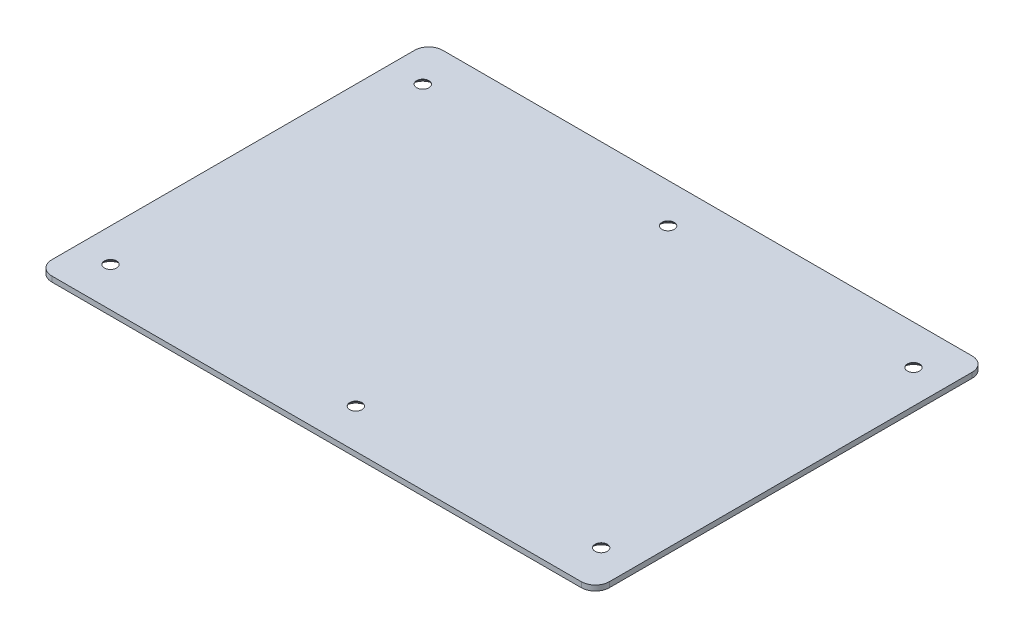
ISO-10303-21;
HEADER;
FILE_DESCRIPTION(('STEP AP214'),'2;1');
FILE_NAME('part.step','',(''),(''),'','','');
FILE_SCHEMA(('AUTOMOTIVE_DESIGN { 1 0 10303 214 1 1 1 1 }'));
ENDSEC;
DATA;
#1=APPLICATION_CONTEXT('core data for automotive mechanical design processes');
#2=APPLICATION_PROTOCOL_DEFINITION('international standard','automotive_design',2000,#1);
#3=PRODUCT_CONTEXT('',#1,'mechanical');
#4=PRODUCT('Part','Part','',(#3));
#5=PRODUCT_RELATED_PRODUCT_CATEGORY('part','',(#4));
#6=PRODUCT_DEFINITION_FORMATION('','',#4);
#7=PRODUCT_DEFINITION_CONTEXT('part definition',#1,'design');
#8=PRODUCT_DEFINITION('design','',#6,#7);
#9=PRODUCT_DEFINITION_SHAPE('','',#8);
#10=(LENGTH_UNIT() NAMED_UNIT(*) SI_UNIT(.MILLI.,.METRE.));
#11=(NAMED_UNIT(*) PLANE_ANGLE_UNIT() SI_UNIT($,.RADIAN.));
#12=(NAMED_UNIT(*) SI_UNIT($,.STERADIAN.) SOLID_ANGLE_UNIT());
#13=UNCERTAINTY_MEASURE_WITH_UNIT(LENGTH_MEASURE(1.E-05),#10,'distance_accuracy_value','');
#14=(GEOMETRIC_REPRESENTATION_CONTEXT(3) GLOBAL_UNCERTAINTY_ASSIGNED_CONTEXT((#13)) GLOBAL_UNIT_ASSIGNED_CONTEXT((#10,
#11,#12)) REPRESENTATION_CONTEXT('',''));
#15=CARTESIAN_POINT('',(0.,0.,0.));
#16=DIRECTION('',(0.,0.,1.));
#17=DIRECTION('',(1.,0.,0.));
#18=AXIS2_PLACEMENT_3D('',#15,#16,#17);
#19=CARTESIAN_POINT('',(0.,-1.5,0.));
#20=DIRECTION('',(0.,1.,0.));
#21=DIRECTION('',(0.,0.,1.));
#22=AXIS2_PLACEMENT_3D('',#19,#20,#21);
#23=PLANE('',#22);
#24=DIRECTION('',(1.,0.,0.));
#25=VECTOR('',#24,1.);
#26=CARTESIAN_POINT('',(-79.375,-1.5,0.));
#27=LINE('',#26,#25);
#28=CARTESIAN_POINT('',(-75.375,-1.5,0.));
#29=VERTEX_POINT('',#28);
#30=CARTESIAN_POINT('',(75.3749999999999,-1.5,0.));
#31=VERTEX_POINT('',#30);
#32=EDGE_CURVE('E261',#29,#31,#27,.T.);
#33=ORIENTED_EDGE('',*,*,#32,.F.);
#34=CARTESIAN_POINT('',(-75.375,-1.5,-4.));
#35=DIRECTION('',(0.,1.,0.));
#36=DIRECTION('',(0.,0.,1.));
#37=AXIS2_PLACEMENT_3D('',#34,#35,#36);
#38=CIRCLE('',#37,4.);
#39=CARTESIAN_POINT('',(-79.375,-1.5,-4.));
#40=VERTEX_POINT('',#39);
#41=EDGE_CURVE('E184',#29,#40,#38,.F.);
#42=ORIENTED_EDGE('',*,*,#41,.T.);
#43=DIRECTION('',(0.,0.,1.));
#44=VECTOR('',#43,1.);
#45=CARTESIAN_POINT('',(-79.375,-1.5,-111.3));
#46=LINE('',#45,#44);
#47=CARTESIAN_POINT('',(-79.375,-1.5,-107.3));
#48=VERTEX_POINT('',#47);
#49=EDGE_CURVE('E264',#48,#40,#46,.T.);
#50=ORIENTED_EDGE('',*,*,#49,.F.);
#51=CARTESIAN_POINT('',(-75.375,-1.5,-107.3));
#52=DIRECTION('',(0.,1.,0.));
#53=DIRECTION('',(0.,0.,1.));
#54=AXIS2_PLACEMENT_3D('',#51,#52,#53);
#55=CIRCLE('',#54,4.);
#56=CARTESIAN_POINT('',(-75.375,-1.5,-111.3));
#57=VERTEX_POINT('',#56);
#58=EDGE_CURVE('E148',#48,#57,#55,.F.);
#59=ORIENTED_EDGE('',*,*,#58,.T.);
#60=DIRECTION('',(-1.,0.,0.));
#61=VECTOR('',#60,1.);
#62=CARTESIAN_POINT('',(-79.375,-1.5,-111.3));
#63=LINE('',#62,#61);
#64=CARTESIAN_POINT('',(75.3749999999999,-1.5,-111.3));
#65=VERTEX_POINT('',#64);
#66=EDGE_CURVE('E150',#65,#57,#63,.T.);
#67=ORIENTED_EDGE('',*,*,#66,.F.);
#68=CARTESIAN_POINT('',(75.375,-1.5,-107.3));
#69=DIRECTION('',(0.,1.,0.));
#70=DIRECTION('',(0.,0.,1.));
#71=AXIS2_PLACEMENT_3D('',#68,#69,#70);
#72=CIRCLE('',#71,4.);
#73=CARTESIAN_POINT('',(79.375,-1.5,-107.3));
#74=VERTEX_POINT('',#73);
#75=EDGE_CURVE('E69',#65,#74,#72,.F.);
#76=ORIENTED_EDGE('',*,*,#75,.T.);
#77=DIRECTION('',(0.,0.,-1.));
#78=VECTOR('',#77,1.);
#79=CARTESIAN_POINT('',(79.375,-1.5,-111.3));
#80=LINE('',#79,#78);
#81=CARTESIAN_POINT('',(79.375,-1.5,-4.));
#82=VERTEX_POINT('',#81);
#83=EDGE_CURVE('E159',#82,#74,#80,.T.);
#84=ORIENTED_EDGE('',*,*,#83,.F.);
#85=CARTESIAN_POINT('',(75.375,-1.5,-4.));
#86=DIRECTION('',(0.,1.,0.));
#87=DIRECTION('',(0.,0.,1.));
#88=AXIS2_PLACEMENT_3D('',#85,#86,#87);
#89=CIRCLE('',#88,4.);
#90=EDGE_CURVE('E177',#82,#31,#89,.F.);
#91=ORIENTED_EDGE('',*,*,#90,.T.);
#92=EDGE_LOOP('',(#33,#42,#50,#59,#67,#76,#84,#91));
#93=FACE_BOUND('',#92,.T.);
#94=CARTESIAN_POINT('',(0.,-1.5,-100.1));
#95=DIRECTION('',(0.,-1.,0.));
#96=DIRECTION('',(0.,0.,-1.));
#97=AXIS2_PLACEMENT_3D('',#94,#95,#96);
#98=CIRCLE('',#97,3.15);
#99=CARTESIAN_POINT('',(0.,-1.5,-103.25));
#100=VERTEX_POINT('',#99);
#101=EDGE_CURVE('E201',#100,#100,#98,.T.);
#102=ORIENTED_EDGE('',*,*,#101,.F.);
#103=EDGE_LOOP('',(#102));
#104=FACE_BOUND('',#103,.T.);
#105=CARTESIAN_POINT('',(0.,-1.5,-11.2));
#106=DIRECTION('',(0.,-1.,0.));
#107=DIRECTION('',(0.,0.,-1.));
#108=AXIS2_PLACEMENT_3D('',#105,#106,#107);
#109=CIRCLE('',#108,3.15);
#110=CARTESIAN_POINT('',(0.,-1.5,-14.35));
#111=VERTEX_POINT('',#110);
#112=EDGE_CURVE('E245',#111,#111,#109,.T.);
#113=ORIENTED_EDGE('',*,*,#112,.F.);
#114=EDGE_LOOP('',(#113));
#115=FACE_BOUND('',#114,.T.);
#116=CARTESIAN_POINT('',(-69.85,-1.5,-100.1));
#117=DIRECTION('',(0.,-1.,0.));
#118=DIRECTION('',(0.,0.,-1.));
#119=AXIS2_PLACEMENT_3D('',#116,#117,#118);
#120=CIRCLE('',#119,3.15);
#121=CARTESIAN_POINT('',(-69.85,-1.5,-103.25));
#122=VERTEX_POINT('',#121);
#123=EDGE_CURVE('E237',#122,#122,#120,.T.);
#124=ORIENTED_EDGE('',*,*,#123,.F.);
#125=EDGE_LOOP('',(#124));
#126=FACE_BOUND('',#125,.T.);
#127=CARTESIAN_POINT('',(-69.85,-1.5,-11.2));
#128=DIRECTION('',(0.,-1.,0.));
#129=DIRECTION('',(0.,0.,-1.));
#130=AXIS2_PLACEMENT_3D('',#127,#128,#129);
#131=CIRCLE('',#130,3.15);
#132=CARTESIAN_POINT('',(-69.85,-1.5,-14.35));
#133=VERTEX_POINT('',#132);
#134=EDGE_CURVE('E297',#133,#133,#131,.T.);
#135=ORIENTED_EDGE('',*,*,#134,.F.);
#136=EDGE_LOOP('',(#135));
#137=FACE_BOUND('',#136,.T.);
#138=CARTESIAN_POINT('',(69.85,-1.5,-11.2));
#139=DIRECTION('',(0.,-1.,0.));
#140=DIRECTION('',(0.,0.,-1.));
#141=AXIS2_PLACEMENT_3D('',#138,#139,#140);
#142=CIRCLE('',#141,3.15);
#143=CARTESIAN_POINT('',(69.85,-1.5,-14.35));
#144=VERTEX_POINT('',#143);
#145=EDGE_CURVE('E273',#144,#144,#142,.T.);
#146=ORIENTED_EDGE('',*,*,#145,.F.);
#147=EDGE_LOOP('',(#146));
#148=FACE_BOUND('',#147,.T.);
#149=CARTESIAN_POINT('',(69.85,-1.5,-100.1));
#150=DIRECTION('',(0.,-1.,0.));
#151=DIRECTION('',(0.,0.,-1.));
#152=AXIS2_PLACEMENT_3D('',#149,#150,#151);
#153=CIRCLE('',#152,3.15);
#154=CARTESIAN_POINT('',(69.85,-1.5,-103.25));
#155=VERTEX_POINT('',#154);
#156=EDGE_CURVE('E211',#155,#155,#153,.T.);
#157=ORIENTED_EDGE('',*,*,#156,.F.);
#158=EDGE_LOOP('',(#157));
#159=FACE_BOUND('',#158,.T.);
#160=ADVANCED_FACE('F53',(#93,#104,#115,#126,#137,#148,#159),#23,.F.);
#161=CARTESIAN_POINT('',(-79.375,-1.5,-111.3));
#162=DIRECTION('',(-1.,0.,0.));
#163=DIRECTION('',(0.,0.,1.));
#164=AXIS2_PLACEMENT_3D('',#161,#162,#163);
#165=PLANE('',#164);
#166=ORIENTED_EDGE('',*,*,#49,.T.);
#167=DIRECTION('',(0.,1.,0.));
#168=VECTOR('',#167,1.);
#169=CARTESIAN_POINT('',(-79.375,-1.5,-4.));
#170=LINE('',#169,#168);
#171=CARTESIAN_POINT('',(-79.375,0.,-4.));
#172=VERTEX_POINT('',#171);
#173=EDGE_CURVE('E141',#40,#172,#170,.T.);
#174=ORIENTED_EDGE('',*,*,#173,.T.);
#175=DIRECTION('',(0.,0.,1.));
#176=VECTOR('',#175,1.);
#177=CARTESIAN_POINT('',(-79.375,0.,-111.3));
#178=LINE('',#177,#176);
#179=CARTESIAN_POINT('',(-79.375,0.,-107.3));
#180=VERTEX_POINT('',#179);
#181=EDGE_CURVE('E123',#180,#172,#178,.T.);
#182=ORIENTED_EDGE('',*,*,#181,.F.);
#183=DIRECTION('',(0.,1.,0.));
#184=VECTOR('',#183,1.);
#185=CARTESIAN_POINT('',(-79.375,-1.5,-107.3));
#186=LINE('',#185,#184);
#187=EDGE_CURVE('E138',#180,#48,#186,.F.);
#188=ORIENTED_EDGE('',*,*,#187,.T.);
#189=EDGE_LOOP('',(#166,#174,#182,#188));
#190=FACE_BOUND('',#189,.T.);
#191=ADVANCED_FACE('F137',(#190),#165,.T.);
#192=CARTESIAN_POINT('',(-79.375,-1.5,-111.3));
#193=DIRECTION('',(0.,0.,-1.));
#194=DIRECTION('',(-1.,0.,0.));
#195=AXIS2_PLACEMENT_3D('',#192,#193,#194);
#196=PLANE('',#195);
#197=ORIENTED_EDGE('',*,*,#66,.T.);
#198=DIRECTION('',(0.,1.,0.));
#199=VECTOR('',#198,1.);
#200=CARTESIAN_POINT('',(-75.375,-1.5,-111.3));
#201=LINE('',#200,#199);
#202=CARTESIAN_POINT('',(-75.375,0.,-111.3));
#203=VERTEX_POINT('',#202);
#204=EDGE_CURVE('E190',#57,#203,#201,.T.);
#205=ORIENTED_EDGE('',*,*,#204,.T.);
#206=DIRECTION('',(-1.,0.,0.));
#207=VECTOR('',#206,1.);
#208=CARTESIAN_POINT('',(-79.375,0.,-111.3));
#209=LINE('',#208,#207);
#210=CARTESIAN_POINT('',(75.3749999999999,0.,-111.3));
#211=VERTEX_POINT('',#210);
#212=EDGE_CURVE('E125',#211,#203,#209,.T.);
#213=ORIENTED_EDGE('',*,*,#212,.F.);
#214=DIRECTION('',(0.,1.,0.));
#215=VECTOR('',#214,1.);
#216=CARTESIAN_POINT('',(75.375,-1.5,-111.3));
#217=LINE('',#216,#215);
#218=EDGE_CURVE('E187',#211,#65,#217,.F.);
#219=ORIENTED_EDGE('',*,*,#218,.T.);
#220=EDGE_LOOP('',(#197,#205,#213,#219));
#221=FACE_BOUND('',#220,.T.);
#222=ADVANCED_FACE('F376',(#221),#196,.T.);
#223=CARTESIAN_POINT('',(79.375,-1.5,-111.3));
#224=DIRECTION('',(1.,0.,0.));
#225=DIRECTION('',(0.,0.,-1.));
#226=AXIS2_PLACEMENT_3D('',#223,#224,#225);
#227=PLANE('',#226);
#228=ORIENTED_EDGE('',*,*,#83,.T.);
#229=DIRECTION('',(0.,1.,0.));
#230=VECTOR('',#229,1.);
#231=CARTESIAN_POINT('',(79.375,-1.5,-107.3));
#232=LINE('',#231,#230);
#233=CARTESIAN_POINT('',(79.375,0.,-107.3));
#234=VERTEX_POINT('',#233);
#235=EDGE_CURVE('E11',#74,#234,#232,.T.);
#236=ORIENTED_EDGE('',*,*,#235,.T.);
#237=DIRECTION('',(0.,0.,-1.));
#238=VECTOR('',#237,1.);
#239=CARTESIAN_POINT('',(79.375,0.,-111.3));
#240=LINE('',#239,#238);
#241=CARTESIAN_POINT('',(79.375,0.,-4.));
#242=VERTEX_POINT('',#241);
#243=EDGE_CURVE('E330',#242,#234,#240,.T.);
#244=ORIENTED_EDGE('',*,*,#243,.F.);
#245=DIRECTION('',(0.,1.,0.));
#246=VECTOR('',#245,1.);
#247=CARTESIAN_POINT('',(79.375,-1.5,-4.));
#248=LINE('',#247,#246);
#249=EDGE_CURVE('E62',#242,#82,#248,.F.);
#250=ORIENTED_EDGE('',*,*,#249,.T.);
#251=EDGE_LOOP('',(#228,#236,#244,#250));
#252=FACE_BOUND('',#251,.T.);
#253=ADVANCED_FACE('F361',(#252),#227,.T.);
#254=CARTESIAN_POINT('',(-79.375,-1.5,0.));
#255=DIRECTION('',(0.,0.,1.));
#256=DIRECTION('',(1.,0.,0.));
#257=AXIS2_PLACEMENT_3D('',#254,#255,#256);
#258=PLANE('',#257);
#259=DIRECTION('',(1.,0.,0.));
#260=VECTOR('',#259,1.);
#261=CARTESIAN_POINT('',(-79.375,0.,0.));
#262=LINE('',#261,#260);
#263=CARTESIAN_POINT('',(-75.375,0.,0.));
#264=VERTEX_POINT('',#263);
#265=CARTESIAN_POINT('',(75.3749999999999,0.,0.));
#266=VERTEX_POINT('',#265);
#267=EDGE_CURVE('E143',#264,#266,#262,.T.);
#268=ORIENTED_EDGE('',*,*,#267,.F.);
#269=DIRECTION('',(0.,1.,0.));
#270=VECTOR('',#269,1.);
#271=CARTESIAN_POINT('',(-75.375,-1.5,0.));
#272=LINE('',#271,#270);
#273=EDGE_CURVE('E174',#264,#29,#272,.F.);
#274=ORIENTED_EDGE('',*,*,#273,.T.);
#275=ORIENTED_EDGE('',*,*,#32,.T.);
#276=DIRECTION('',(0.,1.,0.));
#277=VECTOR('',#276,1.);
#278=CARTESIAN_POINT('',(75.375,-1.5,0.));
#279=LINE('',#278,#277);
#280=EDGE_CURVE('E170',#31,#266,#279,.T.);
#281=ORIENTED_EDGE('',*,*,#280,.T.);
#282=EDGE_LOOP('',(#268,#274,#275,#281));
#283=FACE_BOUND('',#282,.T.);
#284=ADVANCED_FACE('F371',(#283),#258,.T.);
#285=CARTESIAN_POINT('',(0.,0.,0.));
#286=DIRECTION('',(0.,1.,0.));
#287=DIRECTION('',(0.,0.,1.));
#288=AXIS2_PLACEMENT_3D('',#285,#286,#287);
#289=PLANE('',#288);
#290=CARTESIAN_POINT('',(69.85,0.,-100.1));
#291=DIRECTION('',(0.,1.,0.));
#292=DIRECTION('',(0.,0.,1.));
#293=AXIS2_PLACEMENT_3D('',#290,#291,#292);
#294=CIRCLE('',#293,1.75);
#295=CARTESIAN_POINT('',(69.85,0.,-98.35));
#296=VERTEX_POINT('',#295);
#297=EDGE_CURVE('E210',#296,#296,#294,.T.);
#298=ORIENTED_EDGE('',*,*,#297,.F.);
#299=EDGE_LOOP('',(#298));
#300=FACE_BOUND('',#299,.T.);
#301=CARTESIAN_POINT('',(69.85,0.,-11.2));
#302=DIRECTION('',(0.,1.,0.));
#303=DIRECTION('',(0.,0.,1.));
#304=AXIS2_PLACEMENT_3D('',#301,#302,#303);
#305=CIRCLE('',#304,1.75);
#306=CARTESIAN_POINT('',(69.85,0.,-9.45000000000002));
#307=VERTEX_POINT('',#306);
#308=EDGE_CURVE('E272',#307,#307,#305,.T.);
#309=ORIENTED_EDGE('',*,*,#308,.F.);
#310=EDGE_LOOP('',(#309));
#311=FACE_BOUND('',#310,.T.);
#312=CARTESIAN_POINT('',(-69.85,0.,-11.2));
#313=DIRECTION('',(0.,1.,0.));
#314=DIRECTION('',(0.,0.,1.));
#315=AXIS2_PLACEMENT_3D('',#312,#313,#314);
#316=CIRCLE('',#315,1.75);
#317=CARTESIAN_POINT('',(-69.85,0.,-9.45));
#318=VERTEX_POINT('',#317);
#319=EDGE_CURVE('E314',#318,#318,#316,.T.);
#320=ORIENTED_EDGE('',*,*,#319,.F.);
#321=EDGE_LOOP('',(#320));
#322=FACE_BOUND('',#321,.T.);
#323=CARTESIAN_POINT('',(-69.85,0.,-100.1));
#324=DIRECTION('',(0.,1.,0.));
#325=DIRECTION('',(0.,0.,1.));
#326=AXIS2_PLACEMENT_3D('',#323,#324,#325);
#327=CIRCLE('',#326,1.75);
#328=CARTESIAN_POINT('',(-69.85,0.,-98.35));
#329=VERTEX_POINT('',#328);
#330=EDGE_CURVE('E236',#329,#329,#327,.T.);
#331=ORIENTED_EDGE('',*,*,#330,.F.);
#332=EDGE_LOOP('',(#331));
#333=FACE_BOUND('',#332,.T.);
#334=CARTESIAN_POINT('',(0.,0.,-11.2));
#335=DIRECTION('',(0.,1.,0.));
#336=DIRECTION('',(0.,0.,1.));
#337=AXIS2_PLACEMENT_3D('',#334,#335,#336);
#338=CIRCLE('',#337,1.75);
#339=CARTESIAN_POINT('',(0.,0.,-9.45000000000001));
#340=VERTEX_POINT('',#339);
#341=EDGE_CURVE('E197',#340,#340,#338,.T.);
#342=ORIENTED_EDGE('',*,*,#341,.F.);
#343=EDGE_LOOP('',(#342));
#344=FACE_BOUND('',#343,.T.);
#345=CARTESIAN_POINT('',(0.,0.,-100.1));
#346=DIRECTION('',(0.,1.,0.));
#347=DIRECTION('',(0.,0.,1.));
#348=AXIS2_PLACEMENT_3D('',#345,#346,#347);
#349=CIRCLE('',#348,1.75);
#350=CARTESIAN_POINT('',(0.,0.,-98.35));
#351=VERTEX_POINT('',#350);
#352=EDGE_CURVE('E144',#351,#351,#349,.T.);
#353=ORIENTED_EDGE('',*,*,#352,.F.);
#354=EDGE_LOOP('',(#353));
#355=FACE_BOUND('',#354,.T.);
#356=ORIENTED_EDGE('',*,*,#181,.T.);
#357=CARTESIAN_POINT('',(-75.375,0.,-4.));
#358=DIRECTION('',(0.,1.,0.));
#359=DIRECTION('',(0.,0.,1.));
#360=AXIS2_PLACEMENT_3D('',#357,#358,#359);
#361=CIRCLE('',#360,4.);
#362=EDGE_CURVE('E131',#172,#264,#361,.T.);
#363=ORIENTED_EDGE('',*,*,#362,.T.);
#364=ORIENTED_EDGE('',*,*,#267,.T.);
#365=CARTESIAN_POINT('',(75.375,0.,-4.));
#366=DIRECTION('',(0.,1.,0.));
#367=DIRECTION('',(0.,0.,1.));
#368=AXIS2_PLACEMENT_3D('',#365,#366,#367);
#369=CIRCLE('',#368,4.);
#370=EDGE_CURVE('E156',#266,#242,#369,.T.);
#371=ORIENTED_EDGE('',*,*,#370,.T.);
#372=ORIENTED_EDGE('',*,*,#243,.T.);
#373=CARTESIAN_POINT('',(75.375,0.,-107.3));
#374=DIRECTION('',(0.,1.,0.));
#375=DIRECTION('',(0.,0.,1.));
#376=AXIS2_PLACEMENT_3D('',#373,#374,#375);
#377=CIRCLE('',#376,4.);
#378=EDGE_CURVE('E132',#234,#211,#377,.T.);
#379=ORIENTED_EDGE('',*,*,#378,.T.);
#380=ORIENTED_EDGE('',*,*,#212,.T.);
#381=CARTESIAN_POINT('',(-75.375,0.,-107.3));
#382=DIRECTION('',(0.,1.,0.));
#383=DIRECTION('',(0.,0.,1.));
#384=AXIS2_PLACEMENT_3D('',#381,#382,#383);
#385=CIRCLE('',#384,4.);
#386=EDGE_CURVE('E120',#203,#180,#385,.T.);
#387=ORIENTED_EDGE('',*,*,#386,.T.);
#388=EDGE_LOOP('',(#356,#363,#364,#371,#372,#379,#380,#387));
#389=FACE_BOUND('',#388,.T.);
#390=ADVANCED_FACE('F122',(#300,#311,#322,#333,#344,#355,#389),#289,.T.);
#391=CARTESIAN_POINT('',(0.,-1.5,-100.1));
#392=DIRECTION('',(0.,-1.,0.));
#393=DIRECTION('',(0.,0.,-1.));
#394=AXIS2_PLACEMENT_3D('',#391,#392,#393);
#395=CYLINDRICAL_SURFACE('',#394,1.75);
#396=CARTESIAN_POINT('',(0.,-0.100000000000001,-100.1));
#397=DIRECTION('',(0.,-1.,0.));
#398=DIRECTION('',(0.,0.,-1.));
#399=AXIS2_PLACEMENT_3D('',#396,#397,#398);
#400=CIRCLE('',#399,1.75);
#401=CARTESIAN_POINT('',(0.,-0.100000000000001,-101.85));
#402=VERTEX_POINT('',#401);
#403=EDGE_CURVE('E228',#402,#402,#400,.T.);
#404=ORIENTED_EDGE('',*,*,#403,.T.);
#405=EDGE_LOOP('',(#404));
#406=FACE_BOUND('',#405,.T.);
#407=ORIENTED_EDGE('',*,*,#352,.T.);
#408=EDGE_LOOP('',(#407));
#409=FACE_BOUND('',#408,.T.);
#410=ADVANCED_FACE('F392',(#406,#409),#395,.F.);
#411=CARTESIAN_POINT('',(0.,-1.5,-100.1));
#412=DIRECTION('',(0.,-1.,0.));
#413=DIRECTION('',(0.,0.,-1.));
#414=AXIS2_PLACEMENT_3D('',#411,#412,#413);
#415=CONICAL_SURFACE('',#414,3.15,0.785398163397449);
#416=ORIENTED_EDGE('',*,*,#403,.F.);
#417=EDGE_LOOP('',(#416));
#418=FACE_BOUND('',#417,.T.);
#419=ORIENTED_EDGE('',*,*,#101,.T.);
#420=EDGE_LOOP('',(#419));
#421=FACE_BOUND('',#420,.T.);
#422=ADVANCED_FACE('F446',(#418,#421),#415,.F.);
#423=CARTESIAN_POINT('',(0.,-1.5,-11.2));
#424=DIRECTION('',(0.,-1.,0.));
#425=DIRECTION('',(0.,0.,-1.));
#426=AXIS2_PLACEMENT_3D('',#423,#424,#425);
#427=CYLINDRICAL_SURFACE('',#426,1.75);
#428=CARTESIAN_POINT('',(0.,-0.100000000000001,-11.2));
#429=DIRECTION('',(0.,-1.,0.));
#430=DIRECTION('',(0.,0.,-1.));
#431=AXIS2_PLACEMENT_3D('',#428,#429,#430);
#432=CIRCLE('',#431,1.75);
#433=CARTESIAN_POINT('',(0.,-0.100000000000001,-12.95));
#434=VERTEX_POINT('',#433);
#435=EDGE_CURVE('E202',#434,#434,#432,.T.);
#436=ORIENTED_EDGE('',*,*,#435,.T.);
#437=EDGE_LOOP('',(#436));
#438=FACE_BOUND('',#437,.T.);
#439=ORIENTED_EDGE('',*,*,#341,.T.);
#440=EDGE_LOOP('',(#439));
#441=FACE_BOUND('',#440,.T.);
#442=ADVANCED_FACE('F443',(#438,#441),#427,.F.);
#443=CARTESIAN_POINT('',(0.,-1.5,-11.2));
#444=DIRECTION('',(0.,-1.,0.));
#445=DIRECTION('',(0.,0.,-1.));
#446=AXIS2_PLACEMENT_3D('',#443,#444,#445);
#447=CONICAL_SURFACE('',#446,3.15,0.785398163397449);
#448=ORIENTED_EDGE('',*,*,#435,.F.);
#449=EDGE_LOOP('',(#448));
#450=FACE_BOUND('',#449,.T.);
#451=ORIENTED_EDGE('',*,*,#112,.T.);
#452=EDGE_LOOP('',(#451));
#453=FACE_BOUND('',#452,.T.);
#454=ADVANCED_FACE('F439',(#450,#453),#447,.F.);
#455=CARTESIAN_POINT('',(-69.85,-1.5,-100.1));
#456=DIRECTION('',(0.,-1.,0.));
#457=DIRECTION('',(0.,0.,-1.));
#458=AXIS2_PLACEMENT_3D('',#455,#456,#457);
#459=CYLINDRICAL_SURFACE('',#458,1.75);
#460=CARTESIAN_POINT('',(-69.85,-0.100000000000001,-100.1));
#461=DIRECTION('',(0.,-1.,0.));
#462=DIRECTION('',(0.,0.,-1.));
#463=AXIS2_PLACEMENT_3D('',#460,#461,#462);
#464=CIRCLE('',#463,1.75);
#465=CARTESIAN_POINT('',(-69.85,-0.100000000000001,-101.85));
#466=VERTEX_POINT('',#465);
#467=EDGE_CURVE('E233',#466,#466,#464,.T.);
#468=ORIENTED_EDGE('',*,*,#467,.T.);
#469=EDGE_LOOP('',(#468));
#470=FACE_BOUND('',#469,.T.);
#471=ORIENTED_EDGE('',*,*,#330,.T.);
#472=EDGE_LOOP('',(#471));
#473=FACE_BOUND('',#472,.T.);
#474=ADVANCED_FACE('F435',(#470,#473),#459,.F.);
#475=CARTESIAN_POINT('',(-69.85,-1.5,-100.1));
#476=DIRECTION('',(0.,-1.,0.));
#477=DIRECTION('',(0.,0.,-1.));
#478=AXIS2_PLACEMENT_3D('',#475,#476,#477);
#479=CONICAL_SURFACE('',#478,3.15,0.785398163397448);
#480=ORIENTED_EDGE('',*,*,#467,.F.);
#481=EDGE_LOOP('',(#480));
#482=FACE_BOUND('',#481,.T.);
#483=ORIENTED_EDGE('',*,*,#123,.T.);
#484=EDGE_LOOP('',(#483));
#485=FACE_BOUND('',#484,.T.);
#486=ADVANCED_FACE('F431',(#482,#485),#479,.F.);
#487=CARTESIAN_POINT('',(-69.85,-1.5,-11.2));
#488=DIRECTION('',(0.,-1.,0.));
#489=DIRECTION('',(0.,0.,-1.));
#490=AXIS2_PLACEMENT_3D('',#487,#488,#489);
#491=CYLINDRICAL_SURFACE('',#490,1.75);
#492=CARTESIAN_POINT('',(-69.85,-0.100000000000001,-11.2));
#493=DIRECTION('',(0.,-1.,0.));
#494=DIRECTION('',(0.,0.,-1.));
#495=AXIS2_PLACEMENT_3D('',#492,#493,#494);
#496=CIRCLE('',#495,1.75);
#497=CARTESIAN_POINT('',(-69.85,-0.100000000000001,-12.95));
#498=VERTEX_POINT('',#497);
#499=EDGE_CURVE('E299',#498,#498,#496,.T.);
#500=ORIENTED_EDGE('',*,*,#499,.T.);
#501=EDGE_LOOP('',(#500));
#502=FACE_BOUND('',#501,.T.);
#503=ORIENTED_EDGE('',*,*,#319,.T.);
#504=EDGE_LOOP('',(#503));
#505=FACE_BOUND('',#504,.T.);
#506=ADVANCED_FACE('F427',(#502,#505),#491,.F.);
#507=CARTESIAN_POINT('',(-69.85,-1.5,-11.2));
#508=DIRECTION('',(0.,-1.,0.));
#509=DIRECTION('',(0.,0.,-1.));
#510=AXIS2_PLACEMENT_3D('',#507,#508,#509);
#511=CONICAL_SURFACE('',#510,3.15,0.785398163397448);
#512=ORIENTED_EDGE('',*,*,#499,.F.);
#513=EDGE_LOOP('',(#512));
#514=FACE_BOUND('',#513,.T.);
#515=ORIENTED_EDGE('',*,*,#134,.T.);
#516=EDGE_LOOP('',(#515));
#517=FACE_BOUND('',#516,.T.);
#518=ADVANCED_FACE('F423',(#514,#517),#511,.F.);
#519=CARTESIAN_POINT('',(69.85,-1.5,-11.2));
#520=DIRECTION('',(0.,-1.,0.));
#521=DIRECTION('',(0.,0.,-1.));
#522=AXIS2_PLACEMENT_3D('',#519,#520,#521);
#523=CYLINDRICAL_SURFACE('',#522,1.75);
#524=CARTESIAN_POINT('',(69.85,-0.100000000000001,-11.2));
#525=DIRECTION('',(0.,-1.,0.));
#526=DIRECTION('',(0.,0.,-1.));
#527=AXIS2_PLACEMENT_3D('',#524,#525,#526);
#528=CIRCLE('',#527,1.75);
#529=CARTESIAN_POINT('',(69.85,-0.100000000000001,-12.95));
#530=VERTEX_POINT('',#529);
#531=EDGE_CURVE('E269',#530,#530,#528,.T.);
#532=ORIENTED_EDGE('',*,*,#531,.T.);
#533=EDGE_LOOP('',(#532));
#534=FACE_BOUND('',#533,.T.);
#535=ORIENTED_EDGE('',*,*,#308,.T.);
#536=EDGE_LOOP('',(#535));
#537=FACE_BOUND('',#536,.T.);
#538=ADVANCED_FACE('F419',(#534,#537),#523,.F.);
#539=CARTESIAN_POINT('',(69.85,-1.5,-11.2));
#540=DIRECTION('',(0.,-1.,0.));
#541=DIRECTION('',(0.,0.,-1.));
#542=AXIS2_PLACEMENT_3D('',#539,#540,#541);
#543=CONICAL_SURFACE('',#542,3.15,0.785398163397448);
#544=ORIENTED_EDGE('',*,*,#531,.F.);
#545=EDGE_LOOP('',(#544));
#546=FACE_BOUND('',#545,.T.);
#547=ORIENTED_EDGE('',*,*,#145,.T.);
#548=EDGE_LOOP('',(#547));
#549=FACE_BOUND('',#548,.T.);
#550=ADVANCED_FACE('F412',(#546,#549),#543,.F.);
#551=CARTESIAN_POINT('',(69.85,-1.5,-100.1));
#552=DIRECTION('',(0.,-1.,0.));
#553=DIRECTION('',(0.,0.,-1.));
#554=AXIS2_PLACEMENT_3D('',#551,#552,#553);
#555=CYLINDRICAL_SURFACE('',#554,1.75);
#556=CARTESIAN_POINT('',(69.85,-0.100000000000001,-100.1));
#557=DIRECTION('',(0.,-1.,0.));
#558=DIRECTION('',(0.,0.,-1.));
#559=AXIS2_PLACEMENT_3D('',#556,#557,#558);
#560=CIRCLE('',#559,1.75);
#561=CARTESIAN_POINT('',(69.85,-0.100000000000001,-101.85));
#562=VERTEX_POINT('',#561);
#563=EDGE_CURVE('E207',#562,#562,#560,.T.);
#564=ORIENTED_EDGE('',*,*,#563,.T.);
#565=EDGE_LOOP('',(#564));
#566=FACE_BOUND('',#565,.T.);
#567=ORIENTED_EDGE('',*,*,#297,.T.);
#568=EDGE_LOOP('',(#567));
#569=FACE_BOUND('',#568,.T.);
#570=ADVANCED_FACE('F407',(#566,#569),#555,.F.);
#571=CARTESIAN_POINT('',(69.85,-1.5,-100.1));
#572=DIRECTION('',(0.,-1.,0.));
#573=DIRECTION('',(0.,0.,-1.));
#574=AXIS2_PLACEMENT_3D('',#571,#572,#573);
#575=CONICAL_SURFACE('',#574,3.15,0.785398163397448);
#576=ORIENTED_EDGE('',*,*,#563,.F.);
#577=EDGE_LOOP('',(#576));
#578=FACE_BOUND('',#577,.T.);
#579=ORIENTED_EDGE('',*,*,#156,.T.);
#580=EDGE_LOOP('',(#579));
#581=FACE_BOUND('',#580,.T.);
#582=ADVANCED_FACE('F404',(#578,#581),#575,.F.);
#583=CARTESIAN_POINT('',(-75.375,-1.5,-4.));
#584=DIRECTION('',(0.,1.,0.));
#585=DIRECTION('',(0.,0.,1.));
#586=AXIS2_PLACEMENT_3D('',#583,#584,#585);
#587=CYLINDRICAL_SURFACE('',#586,4.);
#588=ORIENTED_EDGE('',*,*,#41,.F.);
#589=ORIENTED_EDGE('',*,*,#273,.F.);
#590=ORIENTED_EDGE('',*,*,#362,.F.);
#591=ORIENTED_EDGE('',*,*,#173,.F.);
#592=EDGE_LOOP('',(#588,#589,#590,#591));
#593=FACE_BOUND('',#592,.T.);
#594=ADVANCED_FACE('F374',(#593),#587,.T.);
#595=CARTESIAN_POINT('',(-75.375,-1.5,-107.3));
#596=DIRECTION('',(0.,1.,0.));
#597=DIRECTION('',(0.,0.,1.));
#598=AXIS2_PLACEMENT_3D('',#595,#596,#597);
#599=CYLINDRICAL_SURFACE('',#598,4.);
#600=ORIENTED_EDGE('',*,*,#58,.F.);
#601=ORIENTED_EDGE('',*,*,#187,.F.);
#602=ORIENTED_EDGE('',*,*,#386,.F.);
#603=ORIENTED_EDGE('',*,*,#204,.F.);
#604=EDGE_LOOP('',(#600,#601,#602,#603));
#605=FACE_BOUND('',#604,.T.);
#606=ADVANCED_FACE('F147',(#605),#599,.T.);
#607=CARTESIAN_POINT('',(75.375,-1.5,-107.3));
#608=DIRECTION('',(0.,1.,0.));
#609=DIRECTION('',(0.,0.,1.));
#610=AXIS2_PLACEMENT_3D('',#607,#608,#609);
#611=CYLINDRICAL_SURFACE('',#610,4.);
#612=ORIENTED_EDGE('',*,*,#75,.F.);
#613=ORIENTED_EDGE('',*,*,#218,.F.);
#614=ORIENTED_EDGE('',*,*,#378,.F.);
#615=ORIENTED_EDGE('',*,*,#235,.F.);
#616=EDGE_LOOP('',(#612,#613,#614,#615));
#617=FACE_BOUND('',#616,.T.);
#618=ADVANCED_FACE('F379',(#617),#611,.T.);
#619=CARTESIAN_POINT('',(75.375,-1.5,-4.));
#620=DIRECTION('',(0.,1.,0.));
#621=DIRECTION('',(0.,0.,1.));
#622=AXIS2_PLACEMENT_3D('',#619,#620,#621);
#623=CYLINDRICAL_SURFACE('',#622,4.);
#624=ORIENTED_EDGE('',*,*,#90,.F.);
#625=ORIENTED_EDGE('',*,*,#249,.F.);
#626=ORIENTED_EDGE('',*,*,#370,.F.);
#627=ORIENTED_EDGE('',*,*,#280,.F.);
#628=EDGE_LOOP('',(#624,#625,#626,#627));
#629=FACE_BOUND('',#628,.T.);
#630=ADVANCED_FACE('F55',(#629),#623,.T.);
#631=CLOSED_SHELL('',(#160,#191,#222,#253,#284,#390,#410,#422,#442,#454,#474,#486,#506,#518,
#538,#550,#570,#582,#594,#606,#618,#630));
#632=MANIFOLD_SOLID_BREP('B2',#631);
#633=ADVANCED_BREP_SHAPE_REPRESENTATION('',(#18,#632),#14);
#634=SHAPE_DEFINITION_REPRESENTATION(#9,#633);
ENDSEC;
END-ISO-10303-21;
